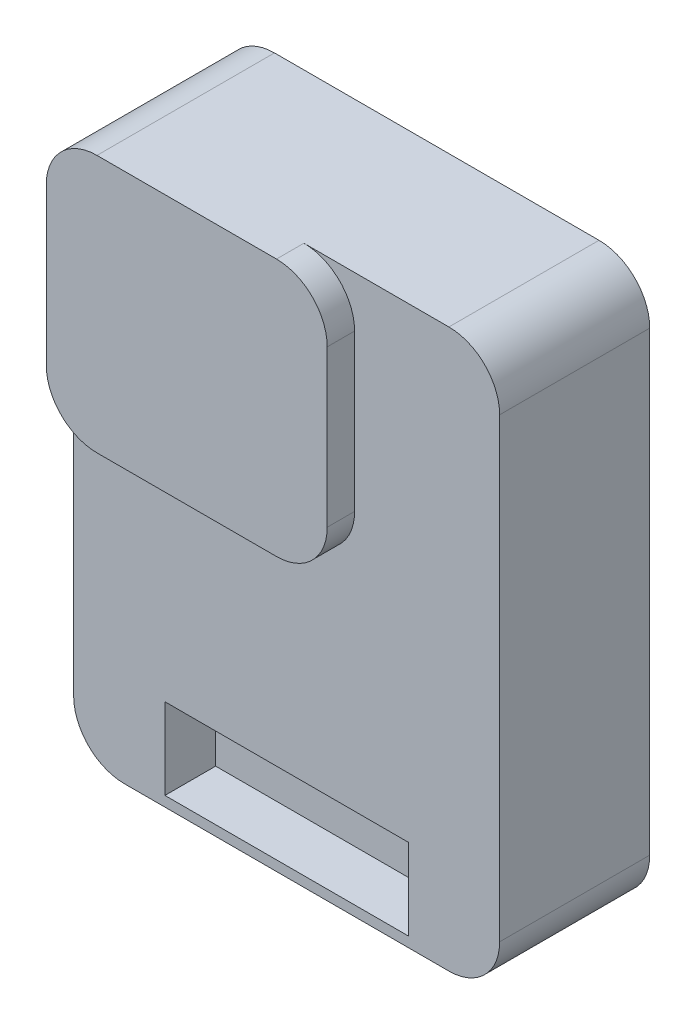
from build123d import *

# Parameters (mm, degrees)
SKETCH_1_W          = 42
SKETCH_1_H          = 55
EXTRUDE_1_DEPTH     = 14.8
SKETCH_2_W          = 27.7
SKETCH_2_H          = 25.4
EXTRUDE_2_DEPTH     = 17.5
FILLET_1_R          = 5
SKETCH_3_W          = 24
SKETCH_3_H          = 8
CUT_EXTRUDE_1_DEPTH = 5


with BuildPart() as part:
    # Sketch 1 → Extrude 1 (new body)
    with BuildSketch(Plane.XY):
        Rectangle(SKETCH_1_W, SKETCH_1_H)
    extrude(amount=EXTRUDE_1_DEPTH)

    # Sketch 2 → Extrude 2 (add)
    with BuildSketch(Plane.XY):
        with Locations((-7.15, 14.8)):
            Rectangle(SKETCH_2_W, SKETCH_2_H)
    extrude(amount=EXTRUDE_2_DEPTH)

    # Fillet 1
    fillet_1_edges = [part.edges().sort_by_distance(p)[0] for p in [
        (-21, 2.1, 16.15),
        (6.7, 2.1, 16.15),
        (6.7, 27.5, 16.15),
        (21, -27.5, 7.4),
        (-21, -27.5, 7.4),
        (-21, 27.5, 8.75),
        (21, 27.5, 7.4),
    ]]
    fillet(fillet_1_edges, radius=FILLET_1_R)

    # Sketch 3 → Cut-Extrude 1 (cut)
    with BuildSketch(Plane.XY.offset(14.8)):
        with Locations((0, -22.5)):
            Rectangle(SKETCH_3_W, SKETCH_3_H)
    extrude(amount=-CUT_EXTRUDE_1_DEPTH, mode=Mode.SUBTRACT)


solid = part.part
